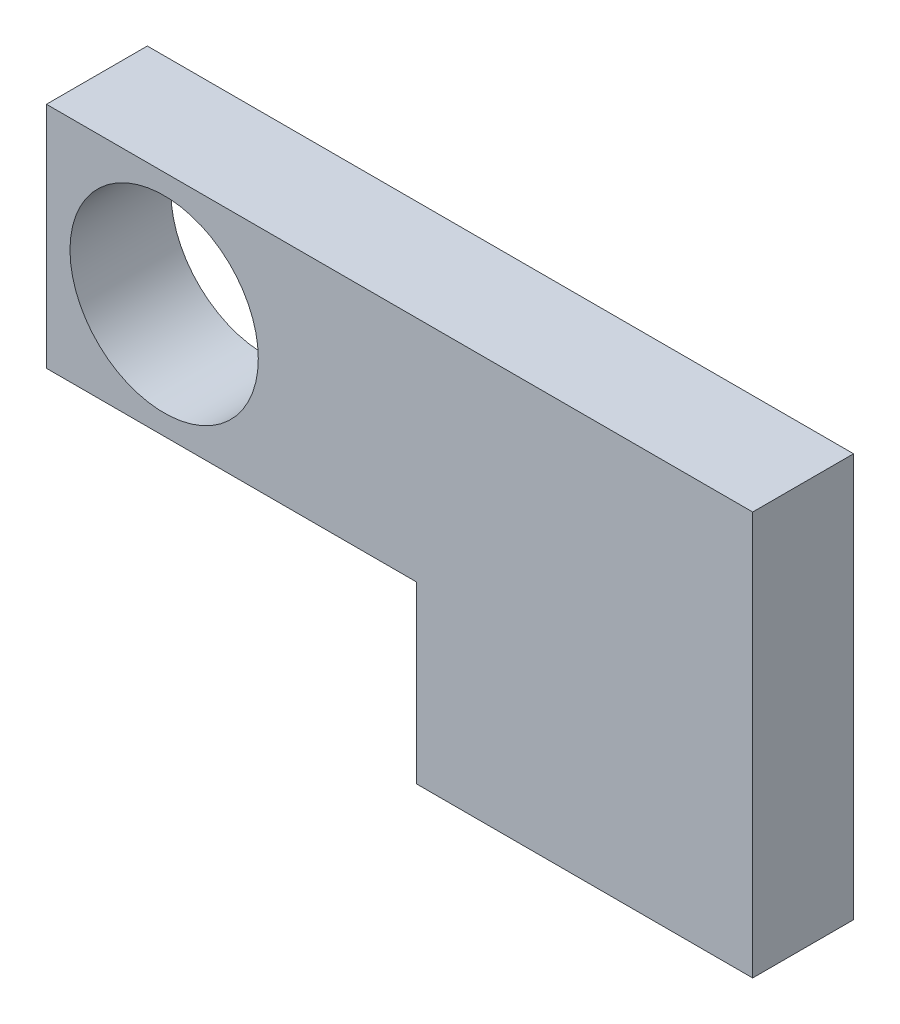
from build123d import *

# Parameters (mm, degrees)
ESQUISSE1_R      = 14
EXTRUSION1_DEPTH = 7.5


with BuildPart() as part:
    # Esquisse1 → Extrusion1 (new, symmetric)
    with BuildSketch(Plane.XY):
        Polygon((0, 0), (-50, 0), (-50, 26), (-105, 26), (-105, 60), (0, 60), align=None)
        with Locations((-87.5, 43)):
            Circle(ESQUISSE1_R, mode=Mode.SUBTRACT)
    extrude(amount=EXTRUSION1_DEPTH, both=True)


solid = part.part
